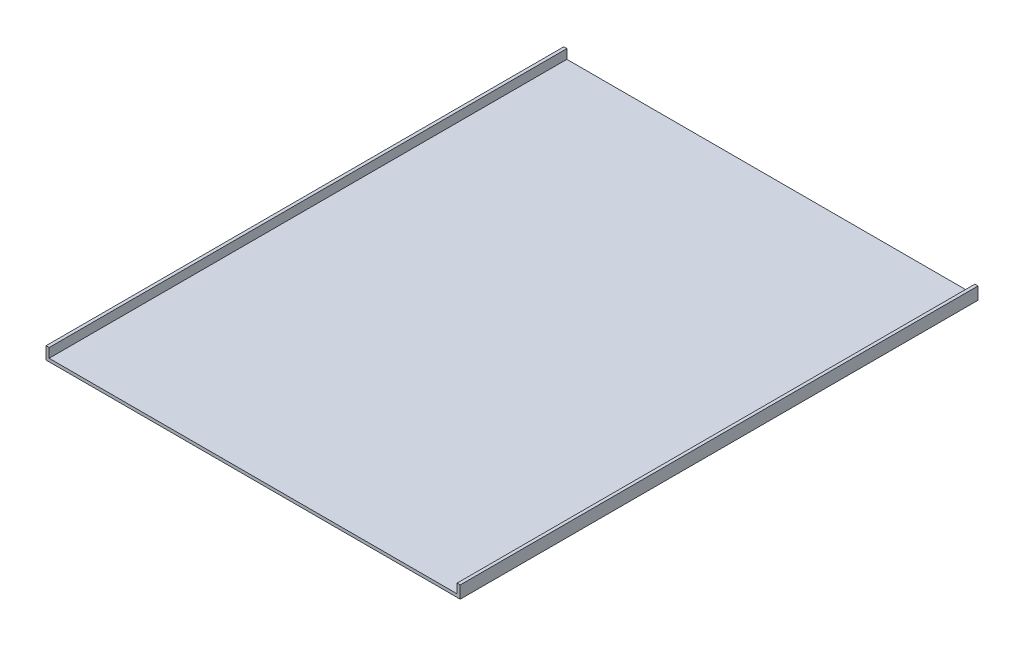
from build123d import *

# Parameters (mm, degrees)
LINEAR_AUSTRAGEN_D_NN1_DEPTH = 500


with BuildPart() as part:
    # Skizze1 → Linear-Austragen-D_nn1 (new body)
    with BuildSketch(Plane.XY):
        Polygon((0, 12), (0, 0), (400, 0), (400, 12), (397, 12), (397, 3), (3, 3), (3, 12), align=None)
    extrude(amount=LINEAR_AUSTRAGEN_D_NN1_DEPTH)


solid = part.part
